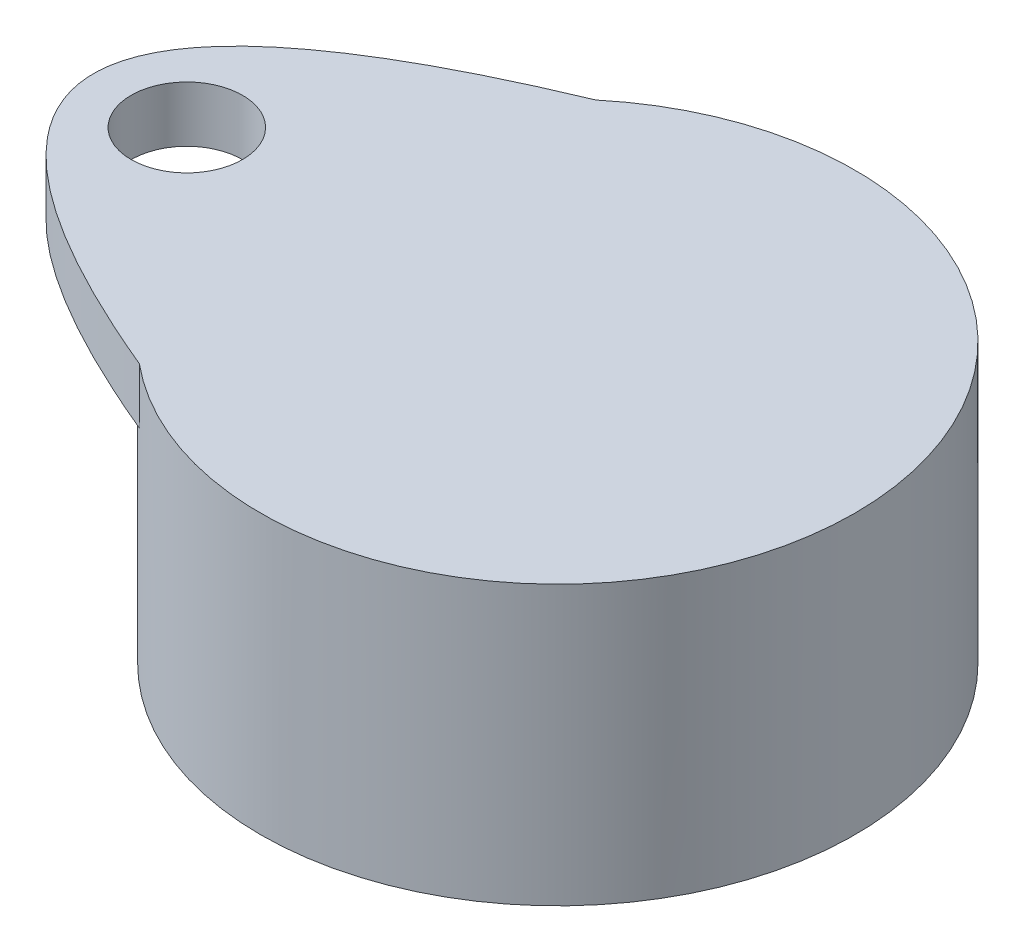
from build123d import *

# Parameters (mm, degrees)
SKETCH1_R           = 16
BOSS_EXTRUDE1_DEPTH = 12
SKETCH2_R           = 11.75
CUT_EXTRUDE1_DEPTH  = 5
BOSS_EXTRUDE2_DEPTH = 3
SKETCH5_R           = 3
CUT_EXTRUDE3_DEPTH  = 3


with BuildPart() as part:
    # Sketch1 → Boss-Extrude1 (new body)
    with BuildSketch(Plane(origin=(0, 0, 0), x_dir=(1, 0, 0), z_dir=(0, 1, 0))):
        with Locations(Location((0, 0, 0), (0, 0, 270))):
            Circle(SKETCH1_R)
    extrude(amount=BOSS_EXTRUDE1_DEPTH)

    # Sketch2 → Cut-Extrude1 (cut)
    with BuildSketch(Plane.XZ):
        with Locations(Location((0, 0, 0), (0, 0, 270))):
            Circle(SKETCH2_R)
    extrude(amount=-CUT_EXTRUDE1_DEPTH, mode=Mode.SUBTRACT)

    # Sketch4 → Boss-Extrude2 (add)
    with BuildSketch(Plane(origin=(0, 12, 0), x_dir=(1, 0, 0), z_dir=(0, 1, 0))):
        with BuildLine():
            ThreePointArc((-10.24, -12.293998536), (16, 0), (-10.24, 12.293998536))
            add(Edge.make_bspline(
                [(-10.24, 12.293998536), (-20.08, 8.195999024), (-29.92, 0), (-20.08, -8.195999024), (-10.24, -12.293998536)],
                knots=[0.115812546, 0.115812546, 0.115812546, 0.115812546, 0.5, 0.884187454, 0.884187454, 0.884187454, 0.884187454], degree=3))
        make_face()
    extrude(amount=BOSS_EXTRUDE2_DEPTH)

    # Sketch5 → Cut-Extrude3 (cut)
    with BuildSketch(Plane(origin=(0, 15, 0), x_dir=(1, 0, 0), z_dir=(0, 1, 0))):
        with Locations(Location((-19.97608013, 0, 0), (0, 0, 270))):
            Circle(SKETCH5_R)
    extrude(amount=-CUT_EXTRUDE3_DEPTH, mode=Mode.SUBTRACT)


solid = part.part
